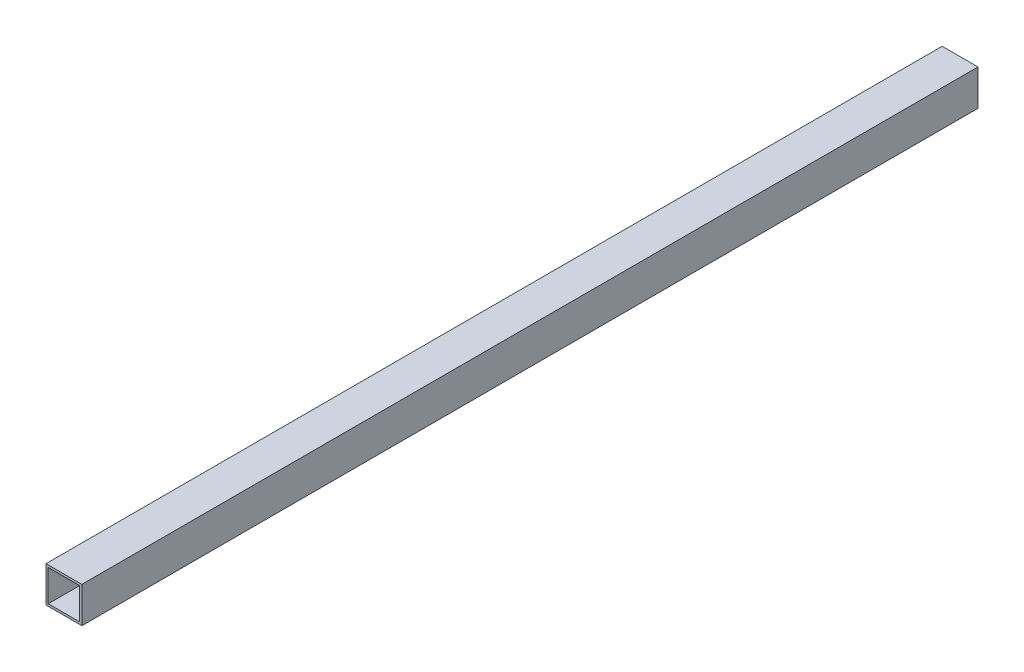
ISO-10303-21;
HEADER;
FILE_DESCRIPTION(('STEP AP214'),'2;1');
FILE_NAME('part.step','',(''),(''),'','','');
FILE_SCHEMA(('AUTOMOTIVE_DESIGN { 1 0 10303 214 1 1 1 1 }'));
ENDSEC;
DATA;
#1=APPLICATION_CONTEXT('core data for automotive mechanical design processes');
#2=APPLICATION_PROTOCOL_DEFINITION('international standard','automotive_design',2000,#1);
#3=PRODUCT_CONTEXT('',#1,'mechanical');
#4=PRODUCT('Part','Part','',(#3));
#5=PRODUCT_RELATED_PRODUCT_CATEGORY('part','',(#4));
#6=PRODUCT_DEFINITION_FORMATION('','',#4);
#7=PRODUCT_DEFINITION_CONTEXT('part definition',#1,'design');
#8=PRODUCT_DEFINITION('design','',#6,#7);
#9=PRODUCT_DEFINITION_SHAPE('','',#8);
#10=(LENGTH_UNIT() NAMED_UNIT(*) SI_UNIT(.MILLI.,.METRE.));
#11=(NAMED_UNIT(*) PLANE_ANGLE_UNIT() SI_UNIT($,.RADIAN.));
#12=(NAMED_UNIT(*) SI_UNIT($,.STERADIAN.) SOLID_ANGLE_UNIT());
#13=UNCERTAINTY_MEASURE_WITH_UNIT(LENGTH_MEASURE(1.E-05),#10,'distance_accuracy_value','');
#14=(GEOMETRIC_REPRESENTATION_CONTEXT(3) GLOBAL_UNCERTAINTY_ASSIGNED_CONTEXT((#13)) GLOBAL_UNIT_ASSIGNED_CONTEXT((#10,
#11,#12)) REPRESENTATION_CONTEXT('',''));
#15=CARTESIAN_POINT('',(0.,0.,0.));
#16=DIRECTION('',(0.,0.,1.));
#17=DIRECTION('',(1.,0.,0.));
#18=AXIS2_PLACEMENT_3D('',#15,#16,#17);
#19=CARTESIAN_POINT('',(-40.,-40.,0.));
#20=DIRECTION('',(0.,0.,1.));
#21=DIRECTION('',(1.,0.,0.));
#22=AXIS2_PLACEMENT_3D('',#19,#20,#21);
#23=PLANE('',#22);
#24=DIRECTION('',(0.,-1.,0.));
#25=VECTOR('',#24,1.);
#26=CARTESIAN_POINT('',(-40.,40.,0.));
#27=LINE('',#26,#25);
#28=CARTESIAN_POINT('',(-40.,40.,0.));
#29=VERTEX_POINT('',#28);
#30=CARTESIAN_POINT('',(-40.,-40.,0.));
#31=VERTEX_POINT('',#30);
#32=EDGE_CURVE('E140',#29,#31,#27,.T.);
#33=ORIENTED_EDGE('',*,*,#32,.F.);
#34=DIRECTION('',(-1.,0.,0.));
#35=VECTOR('',#34,1.);
#36=CARTESIAN_POINT('',(-40.,40.,0.));
#37=LINE('',#36,#35);
#38=CARTESIAN_POINT('',(40.,40.,0.));
#39=VERTEX_POINT('',#38);
#40=EDGE_CURVE('E121',#39,#29,#37,.T.);
#41=ORIENTED_EDGE('',*,*,#40,.F.);
#42=DIRECTION('',(0.,1.,0.));
#43=VECTOR('',#42,1.);
#44=CARTESIAN_POINT('',(40.,40.,0.));
#45=LINE('',#44,#43);
#46=CARTESIAN_POINT('',(40.,-40.,0.));
#47=VERTEX_POINT('',#46);
#48=EDGE_CURVE('E126',#47,#39,#45,.T.);
#49=ORIENTED_EDGE('',*,*,#48,.F.);
#50=DIRECTION('',(1.,0.,0.));
#51=VECTOR('',#50,1.);
#52=CARTESIAN_POINT('',(-40.,-40.,0.));
#53=LINE('',#52,#51);
#54=EDGE_CURVE('E137',#31,#47,#53,.T.);
#55=ORIENTED_EDGE('',*,*,#54,.F.);
#56=EDGE_LOOP('',(#33,#41,#49,#55));
#57=FACE_BOUND('',#56,.T.);
#58=DIRECTION('',(0.,-1.,0.));
#59=VECTOR('',#58,1.);
#60=CARTESIAN_POINT('',(-35.,35.,0.));
#61=LINE('',#60,#59);
#62=CARTESIAN_POINT('',(-35.,35.,0.));
#63=VERTEX_POINT('',#62);
#64=CARTESIAN_POINT('',(-35.,-35.,0.));
#65=VERTEX_POINT('',#64);
#66=EDGE_CURVE('E161',#63,#65,#61,.T.);
#67=ORIENTED_EDGE('',*,*,#66,.T.);
#68=DIRECTION('',(1.,0.,0.));
#69=VECTOR('',#68,1.);
#70=CARTESIAN_POINT('',(-35.,-35.,0.));
#71=LINE('',#70,#69);
#72=CARTESIAN_POINT('',(35.,-35.,0.));
#73=VERTEX_POINT('',#72);
#74=EDGE_CURVE('E158',#65,#73,#71,.T.);
#75=ORIENTED_EDGE('',*,*,#74,.T.);
#76=DIRECTION('',(0.,1.,0.));
#77=VECTOR('',#76,1.);
#78=CARTESIAN_POINT('',(35.,35.,0.));
#79=LINE('',#78,#77);
#80=CARTESIAN_POINT('',(35.,35.,0.));
#81=VERTEX_POINT('',#80);
#82=EDGE_CURVE('E155',#73,#81,#79,.T.);
#83=ORIENTED_EDGE('',*,*,#82,.T.);
#84=DIRECTION('',(-1.,0.,0.));
#85=VECTOR('',#84,1.);
#86=CARTESIAN_POINT('',(-35.,35.,0.));
#87=LINE('',#86,#85);
#88=EDGE_CURVE('E152',#81,#63,#87,.T.);
#89=ORIENTED_EDGE('',*,*,#88,.T.);
#90=EDGE_LOOP('',(#67,#75,#83,#89));
#91=FACE_BOUND('',#90,.T.);
#92=ADVANCED_FACE('F37',(#57,#91),#23,.F.);
#93=CARTESIAN_POINT('',(-40.,40.,2100.));
#94=DIRECTION('',(1.,0.,0.));
#95=DIRECTION('',(0.,0.,-1.));
#96=AXIS2_PLACEMENT_3D('',#93,#94,#95);
#97=PLANE('',#96);
#98=DIRECTION('',(0.,0.,-1.));
#99=VECTOR('',#98,1.);
#100=CARTESIAN_POINT('',(-40.,-40.,2100.));
#101=LINE('',#100,#99);
#102=CARTESIAN_POINT('',(-40.,-40.,2000.));
#103=VERTEX_POINT('',#102);
#104=EDGE_CURVE('E11',#103,#31,#101,.T.);
#105=ORIENTED_EDGE('',*,*,#104,.F.);
#106=DIRECTION('',(0.,1.,0.));
#107=VECTOR('',#106,1.);
#108=CARTESIAN_POINT('',(-40.,-40.,2000.));
#109=LINE('',#108,#107);
#110=CARTESIAN_POINT('',(-40.,40.,2000.));
#111=VERTEX_POINT('',#110);
#112=EDGE_CURVE('E104',#103,#111,#109,.T.);
#113=ORIENTED_EDGE('',*,*,#112,.T.);
#114=DIRECTION('',(0.,0.,-1.));
#115=VECTOR('',#114,1.);
#116=CARTESIAN_POINT('',(-40.,40.,2100.));
#117=LINE('',#116,#115);
#118=EDGE_CURVE('E116',#111,#29,#117,.T.);
#119=ORIENTED_EDGE('',*,*,#118,.T.);
#120=ORIENTED_EDGE('',*,*,#32,.T.);
#121=EDGE_LOOP('',(#105,#113,#119,#120));
#122=FACE_BOUND('',#121,.T.);
#123=ADVANCED_FACE('F39',(#122),#97,.F.);
#124=CARTESIAN_POINT('',(-40.,-40.,2100.));
#125=DIRECTION('',(0.,1.,0.));
#126=DIRECTION('',(0.,0.,1.));
#127=AXIS2_PLACEMENT_3D('',#124,#125,#126);
#128=PLANE('',#127);
#129=DIRECTION('',(0.,0.,-1.));
#130=VECTOR('',#129,1.);
#131=CARTESIAN_POINT('',(40.,-40.,2100.));
#132=LINE('',#131,#130);
#133=CARTESIAN_POINT('',(40.,-40.,2000.));
#134=VERTEX_POINT('',#133);
#135=EDGE_CURVE('E45',#134,#47,#132,.T.);
#136=ORIENTED_EDGE('',*,*,#135,.F.);
#137=DIRECTION('',(1.,0.,0.));
#138=VECTOR('',#137,1.);
#139=CARTESIAN_POINT('',(-40.,-40.,2000.));
#140=LINE('',#139,#138);
#141=EDGE_CURVE('E164',#103,#134,#140,.T.);
#142=ORIENTED_EDGE('',*,*,#141,.F.);
#143=ORIENTED_EDGE('',*,*,#104,.T.);
#144=ORIENTED_EDGE('',*,*,#54,.T.);
#145=EDGE_LOOP('',(#136,#142,#143,#144));
#146=FACE_BOUND('',#145,.T.);
#147=ADVANCED_FACE('F138',(#146),#128,.F.);
#148=CARTESIAN_POINT('',(40.,40.,2100.));
#149=DIRECTION('',(-1.,0.,0.));
#150=DIRECTION('',(0.,-1.,0.));
#151=AXIS2_PLACEMENT_3D('',#148,#149,#150);
#152=PLANE('',#151);
#153=DIRECTION('',(0.,0.,-1.));
#154=VECTOR('',#153,1.);
#155=CARTESIAN_POINT('',(40.,40.,2100.));
#156=LINE('',#155,#154);
#157=CARTESIAN_POINT('',(40.,40.,2000.));
#158=VERTEX_POINT('',#157);
#159=EDGE_CURVE('E123',#158,#39,#156,.T.);
#160=ORIENTED_EDGE('',*,*,#159,.F.);
#161=DIRECTION('',(0.,1.,0.));
#162=VECTOR('',#161,1.);
#163=CARTESIAN_POINT('',(40.,-40.,2000.));
#164=LINE('',#163,#162);
#165=EDGE_CURVE('E107',#134,#158,#164,.T.);
#166=ORIENTED_EDGE('',*,*,#165,.F.);
#167=ORIENTED_EDGE('',*,*,#135,.T.);
#168=ORIENTED_EDGE('',*,*,#48,.T.);
#169=EDGE_LOOP('',(#160,#166,#167,#168));
#170=FACE_BOUND('',#169,.T.);
#171=ADVANCED_FACE('F133',(#170),#152,.F.);
#172=CARTESIAN_POINT('',(-40.,40.,2100.));
#173=DIRECTION('',(0.,-1.,0.));
#174=DIRECTION('',(1.,0.,0.));
#175=AXIS2_PLACEMENT_3D('',#172,#173,#174);
#176=PLANE('',#175);
#177=ORIENTED_EDGE('',*,*,#118,.F.);
#178=DIRECTION('',(1.,0.,0.));
#179=VECTOR('',#178,1.);
#180=CARTESIAN_POINT('',(-40.,40.,2000.));
#181=LINE('',#180,#179);
#182=EDGE_CURVE('E101',#111,#158,#181,.T.);
#183=ORIENTED_EDGE('',*,*,#182,.T.);
#184=ORIENTED_EDGE('',*,*,#159,.T.);
#185=ORIENTED_EDGE('',*,*,#40,.T.);
#186=EDGE_LOOP('',(#177,#183,#184,#185));
#187=FACE_BOUND('',#186,.T.);
#188=ADVANCED_FACE('F119',(#187),#176,.F.);
#189=CARTESIAN_POINT('',(-35.,35.,2100.));
#190=DIRECTION('',(1.,0.,0.));
#191=DIRECTION('',(0.,1.,0.));
#192=AXIS2_PLACEMENT_3D('',#189,#190,#191);
#193=PLANE('',#192);
#194=DIRECTION('',(0.,1.,0.));
#195=VECTOR('',#194,1.);
#196=CARTESIAN_POINT('',(-35.,35.,2000.));
#197=LINE('',#196,#195);
#198=CARTESIAN_POINT('',(-35.,-35.,2000.));
#199=VERTEX_POINT('',#198);
#200=CARTESIAN_POINT('',(-35.,35.,2000.));
#201=VERTEX_POINT('',#200);
#202=EDGE_CURVE('E52',#199,#201,#197,.T.);
#203=ORIENTED_EDGE('',*,*,#202,.F.);
#204=DIRECTION('',(0.,0.,-1.));
#205=VECTOR('',#204,1.);
#206=CARTESIAN_POINT('',(-35.,-35.,2100.));
#207=LINE('',#206,#205);
#208=EDGE_CURVE('E145',#199,#65,#207,.T.);
#209=ORIENTED_EDGE('',*,*,#208,.T.);
#210=ORIENTED_EDGE('',*,*,#66,.F.);
#211=DIRECTION('',(0.,0.,-1.));
#212=VECTOR('',#211,1.);
#213=CARTESIAN_POINT('',(-35.,35.,2100.));
#214=LINE('',#213,#212);
#215=EDGE_CURVE('E59',#201,#63,#214,.T.);
#216=ORIENTED_EDGE('',*,*,#215,.F.);
#217=EDGE_LOOP('',(#203,#209,#210,#216));
#218=FACE_BOUND('',#217,.T.);
#219=ADVANCED_FACE('F185',(#218),#193,.T.);
#220=CARTESIAN_POINT('',(-35.,-35.,2100.));
#221=DIRECTION('',(0.,1.,0.));
#222=DIRECTION('',(0.,0.,1.));
#223=AXIS2_PLACEMENT_3D('',#220,#221,#222);
#224=PLANE('',#223);
#225=DIRECTION('',(-1.,0.,0.));
#226=VECTOR('',#225,1.);
#227=CARTESIAN_POINT('',(-35.,-35.,2000.));
#228=LINE('',#227,#226);
#229=CARTESIAN_POINT('',(35.,-35.,2000.));
#230=VERTEX_POINT('',#229);
#231=EDGE_CURVE('E167',#230,#199,#228,.T.);
#232=ORIENTED_EDGE('',*,*,#231,.F.);
#233=DIRECTION('',(0.,0.,-1.));
#234=VECTOR('',#233,1.);
#235=CARTESIAN_POINT('',(35.,-35.,2100.));
#236=LINE('',#235,#234);
#237=EDGE_CURVE('E147',#230,#73,#236,.T.);
#238=ORIENTED_EDGE('',*,*,#237,.T.);
#239=ORIENTED_EDGE('',*,*,#74,.F.);
#240=ORIENTED_EDGE('',*,*,#208,.F.);
#241=EDGE_LOOP('',(#232,#238,#239,#240));
#242=FACE_BOUND('',#241,.T.);
#243=ADVANCED_FACE('F183',(#242),#224,.T.);
#244=CARTESIAN_POINT('',(35.,35.,2100.));
#245=DIRECTION('',(-1.,0.,0.));
#246=DIRECTION('',(0.,-1.,0.));
#247=AXIS2_PLACEMENT_3D('',#244,#245,#246);
#248=PLANE('',#247);
#249=DIRECTION('',(0.,-1.,0.));
#250=VECTOR('',#249,1.);
#251=CARTESIAN_POINT('',(35.,35.,2000.));
#252=LINE('',#251,#250);
#253=CARTESIAN_POINT('',(35.,35.,2000.));
#254=VERTEX_POINT('',#253);
#255=EDGE_CURVE('E169',#254,#230,#252,.T.);
#256=ORIENTED_EDGE('',*,*,#255,.F.);
#257=DIRECTION('',(0.,0.,-1.));
#258=VECTOR('',#257,1.);
#259=CARTESIAN_POINT('',(35.,35.,2100.));
#260=LINE('',#259,#258);
#261=EDGE_CURVE('E149',#254,#81,#260,.T.);
#262=ORIENTED_EDGE('',*,*,#261,.T.);
#263=ORIENTED_EDGE('',*,*,#82,.F.);
#264=ORIENTED_EDGE('',*,*,#237,.F.);
#265=EDGE_LOOP('',(#256,#262,#263,#264));
#266=FACE_BOUND('',#265,.T.);
#267=ADVANCED_FACE('F177',(#266),#248,.T.);
#268=CARTESIAN_POINT('',(-35.,35.,2100.));
#269=DIRECTION('',(0.,-1.,0.));
#270=DIRECTION('',(0.,0.,-1.));
#271=AXIS2_PLACEMENT_3D('',#268,#269,#270);
#272=PLANE('',#271);
#273=DIRECTION('',(1.,0.,0.));
#274=VECTOR('',#273,1.);
#275=CARTESIAN_POINT('',(-35.,35.,2000.));
#276=LINE('',#275,#274);
#277=EDGE_CURVE('E111',#201,#254,#276,.T.);
#278=ORIENTED_EDGE('',*,*,#277,.F.);
#279=ORIENTED_EDGE('',*,*,#215,.T.);
#280=ORIENTED_EDGE('',*,*,#88,.F.);
#281=ORIENTED_EDGE('',*,*,#261,.F.);
#282=EDGE_LOOP('',(#278,#279,#280,#281));
#283=FACE_BOUND('',#282,.T.);
#284=ADVANCED_FACE('F179',(#283),#272,.T.);
#285=CARTESIAN_POINT('',(-40.,-40.,2000.));
#286=DIRECTION('',(0.,0.,-1.));
#287=DIRECTION('',(-1.,0.,0.));
#288=AXIS2_PLACEMENT_3D('',#285,#286,#287);
#289=PLANE('',#288);
#290=ORIENTED_EDGE('',*,*,#202,.T.);
#291=ORIENTED_EDGE('',*,*,#277,.T.);
#292=ORIENTED_EDGE('',*,*,#255,.T.);
#293=ORIENTED_EDGE('',*,*,#231,.T.);
#294=EDGE_LOOP('',(#290,#291,#292,#293));
#295=FACE_BOUND('',#294,.T.);
#296=ORIENTED_EDGE('',*,*,#165,.T.);
#297=ORIENTED_EDGE('',*,*,#182,.F.);
#298=ORIENTED_EDGE('',*,*,#112,.F.);
#299=ORIENTED_EDGE('',*,*,#141,.T.);
#300=EDGE_LOOP('',(#296,#297,#298,#299));
#301=FACE_BOUND('',#300,.T.);
#302=ADVANCED_FACE('F103',(#295,#301),#289,.F.);
#303=CLOSED_SHELL('',(#92,#123,#147,#171,#188,#219,#243,#267,#284,#302));
#304=MANIFOLD_SOLID_BREP('B2',#303);
#305=ADVANCED_BREP_SHAPE_REPRESENTATION('',(#18,#304),#14);
#306=SHAPE_DEFINITION_REPRESENTATION(#9,#305);
ENDSEC;
END-ISO-10303-21;
